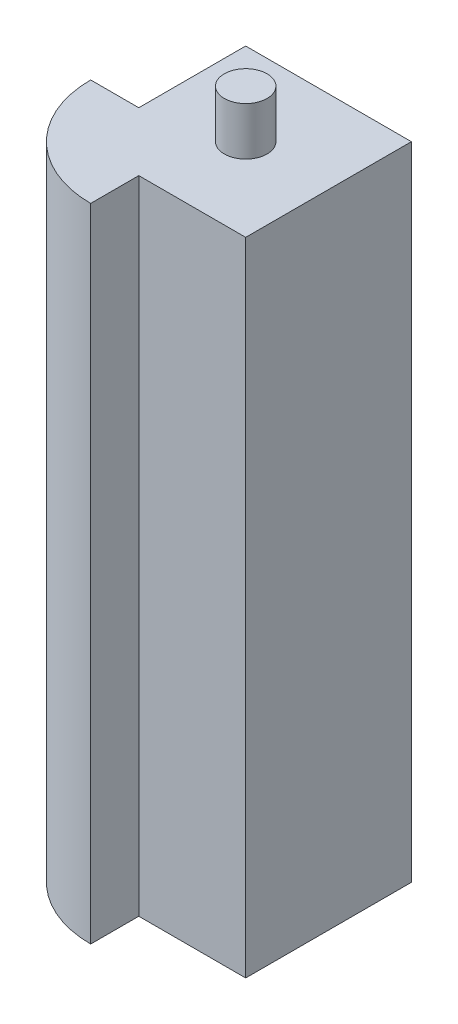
from build123d import *

# Parameters (mm, degrees)
BOSS_EXTRUDE1_DEPTH = 60
SKETCH5_R           = 2
BOSS_EXTRUDE4_DEPTH = 4.5
SKETCH6_R           = 2
CUT_EXTRUDE1_DEPTH  = 3.5
SKETCH8_R           = 2
CUT_EXTRUDE2_DEPTH  = 10


with BuildPart() as part:
    # Sketch1 → Boss-Extrude1 (new body)
    with BuildSketch(Plane(origin=(0, 0, 0), x_dir=(1, 0, 0), z_dir=(0, 1, 0))):
        with BuildLine():
            Line((-5.5, 0), (-10, 0))
            ThreePointArc((-10, 0), (-7.071067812, -7.071067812), (0, -10))
            Line((0, -10), (0, -5.5))
            Line((0, -5.5), (10, -5.5))
            Line((10, -5.5), (10, 10))
            Line((10, 10), (-5.5, 10))
            Line((-5.5, 10), (-5.5, 0))
        make_face()
    extrude(amount=BOSS_EXTRUDE1_DEPTH)

    # Sketch5 → Boss-Extrude4 (add)
    with BuildSketch(Plane(origin=(0, 60, 0), x_dir=(1, 0, 0), z_dir=(0, 1, 0))):
        with Locations(Location((2.25, 2.25, 0), (0, 0, 270))):
            Circle(SKETCH5_R)
    extrude(amount=BOSS_EXTRUDE4_DEPTH)

    # Sketch6 → Cut-Extrude1 (cut)
    # profile 1 of 2: a face of its own
    with BuildSketch(Plane.XZ):
        Polygon((4.270725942, 1.25), (0.229274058, 1.25), (-1.791451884, -2.25), (0.229274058, -5.75), (4.270725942, -5.75), (6.291451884, -2.25), align=None)
        with Locations(Location((2.25, -2.25, 0), (0, 0, 90))):
            Circle(SKETCH6_R, mode=Mode.SUBTRACT)
    # profile 2 of 2: a face of its own
    with BuildSketch(Plane.XZ):
        with Locations(Location((2.25, -2.25, 0), (0, 0, 90))):
            Circle(SKETCH6_R)
    extrude(amount=-CUT_EXTRUDE1_DEPTH, mode=Mode.SUBTRACT)

    # Sketch8 → Cut-Extrude2 (cut)
    with BuildSketch(Plane.XZ.offset(-3.5)):
        with Locations(Location((2.25, -2.25, 0), (0, 0, 90))):
            Circle(SKETCH8_R)
    extrude(amount=-CUT_EXTRUDE2_DEPTH, mode=Mode.SUBTRACT)


solid = part.part
